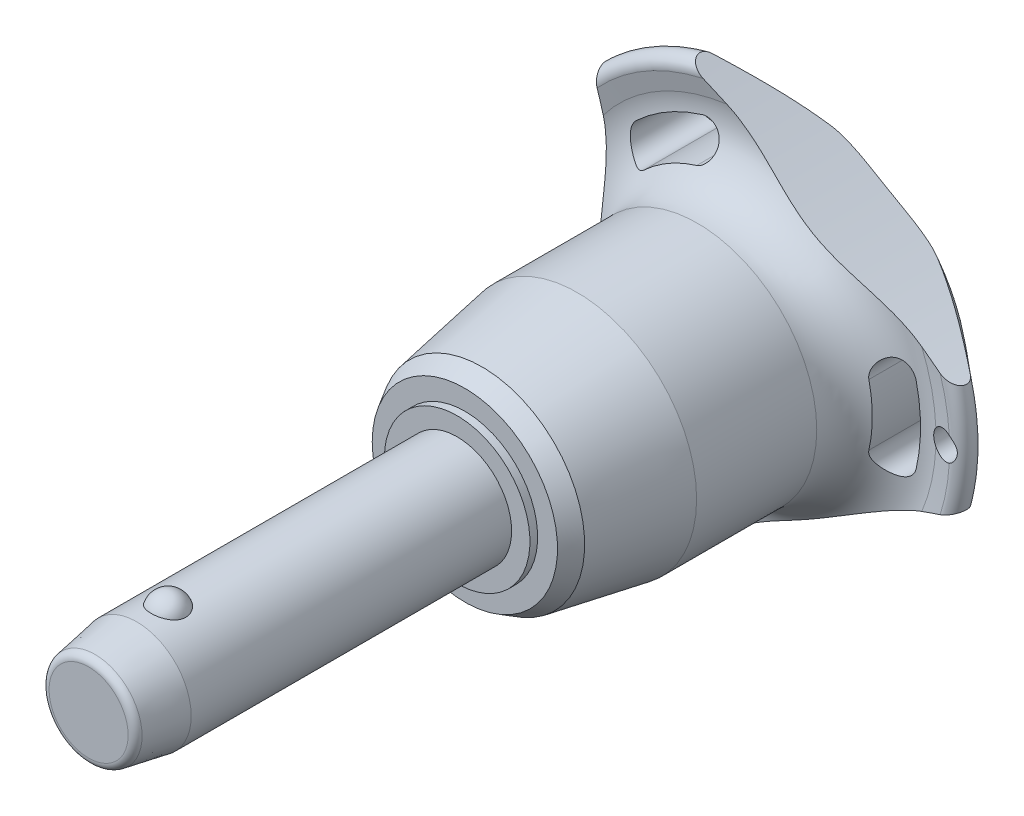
from build123d import *

# Parameters (mm, degrees)
SKETCH1_R           = 6
BOSS_EXTRUDE1_DEPTH = 30
SKETCH2_R           = 5.15
BOSS_EXTRUDE2_DEPTH = 39.7
BOSS_EXTRUDE3_START = 10.6
SKETCH1_2_R         = 6
BOSS_EXTRUDE3_DEPTH = 10.6
CHAMFER1_SIZE       = 5.3
CHAMFER1_SIZE2      = 0.934532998
FILLET1_R           = 0.85
SKETCH6_R           = 144.275
CUT_EXTRUDE1_DEPTH  = 78.404041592
CIRPATTERN1_COUNT   = 3
SKETCH7_R           = 1.5
CUT_EXTRUDE2_DEPTH  = 78.144330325


with BuildPart() as part:
    # Sketch1 → Boss-Extrude1 (new body)
    with BuildSketch(Plane.XY):
        Circle(SKETCH1_R)
    extrude(amount=-BOSS_EXTRUDE1_DEPTH)

    # Sketch2 → Boss-Extrude2 (add)
    with BuildSketch(Plane(origin=(0, 0, -30), x_dir=(-1, 0, 0), z_dir=(0, 0, -1))):
        Circle(SKETCH2_R)
    extrude(amount=BOSS_EXTRUDE2_DEPTH)

    # Sketch3 → Revolve1 (revolve)
    with BuildSketch(Plane(origin=(0, 0, 0), x_dir=(0, 0, -1), z_dir=(1, 0, 0))):
        with BuildLine():
            Line((-1.854049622, 7.25), (-1.854049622, 3.25))
            ThreePointArc((-1.854049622, 3.25), (0.145950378, 5.25), (-1.854049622, 7.25))
        make_face()
        with BuildLine():
            Line((-1.854049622, -3.25), (-1.854049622, -7.25))
            ThreePointArc((-1.854049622, -7.25), (0.145950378, -5.25), (-1.854049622, -3.25))
        make_face()
    revolve(axis=Axis((0, -3.25, 1.854049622), (0, 1, 0)))

    # Sketch1_2 → Boss-Extrude3 (add)
    with BuildSketch(Plane.XY.offset(BOSS_EXTRUDE3_START)):
        Circle(SKETCH1_2_R)
    extrude(amount=-BOSS_EXTRUDE3_DEPTH)

    # Chamfer1
    chamfer1_edges = [part.edges().sort_by_distance(p)[0] for p in [
        (-6, 0, 10.6),
    ]]
    chamfer1_side = [part.faces().sort_by_distance(p)[0] for p in [
        (-6, 0, -9.7),
    ]]
    chamfer(chamfer1_edges, length=CHAMFER1_SIZE, length2=CHAMFER1_SIZE2, reference=chamfer1_side[0])

    # Fillet1
    fillet1_edges = [part.edges().sort_by_distance(p)[0] for p in [
        (-5.065467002, 0, 10.6),
        (5.15, 0, -69.7),
    ]]
    fillet(fillet1_edges, radius=FILLET1_R)

    # Sketch4 → Revolve2 (revolve)
    with BuildSketch(Plane(origin=(0, 0, 0), x_dir=(0, 0, -1), z_dir=(1, 0, 0)), mode=Mode.PRIVATE) as revolve2_sk:
        Polygon((30, 0), (30, 8.017240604), (30.85, 8.017240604), (30.85, 10.206249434), (32.745737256, 11.300753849), (43.233333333, 13.15), (56.466666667, 13.15), (56.466666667, 0), align=None)
    revolve(revolve2_sk.sketch.rotate(Axis((0, 0, -56.466666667), (0, 0, 1)), 90), axis=Axis((0, 0, -56.466666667), (0, 0, 1)))

    # Sketch5 → Revolve3 (revolve)
    with BuildSketch(Plane(origin=(0, 0, 0), x_dir=(0, 0, -1), z_dir=(1, 0, 0)), mode=Mode.PRIVATE) as revolve3_sk:
        with BuildLine():
            Line((62.32877039, 20.428960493), (61.910912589, 22.344207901))
            ThreePointArc((61.910912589, 22.344207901), (62.554394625, 23.677136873), (64.002586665, 23.371345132))
            Line((64.002586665, 23.371345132), (69.141488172, 17.247040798))
            ThreePointArc((69.141488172, 17.247040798), (69.7, 15.584758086), (68.978803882, 13.986322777))
            ThreePointArc((68.978803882, 13.986322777), (64.617427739, 7.589034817), (63.083333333, 0))
            Line((63.083333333, 0), (56.466666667, 0))
            Line((56.466666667, 0), (56.466666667, 13.15))
            ThreePointArc((56.466666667, 13.15), (61.139661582, 15.38660811), (62.32877039, 20.428960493))
        make_face()
    revolve(revolve3_sk.sketch.rotate(Axis((0, 0, -63.083333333), (0, 0, 1)), 90), axis=Axis((0, 0, -63.083333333), (0, 0, 1)))

    # Sketch6 → Cut-Extrude1 (cut, through all)
    with BuildSketch(Plane.XY):
        with Locations((-159.975, 0)):
            Circle(SKETCH6_R)
        with BuildLine():
            ThreePointArc((18.131206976, -4.190753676), (18.60922037, 0), (18.131206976, 4.190753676))
            ThreePointArc((18.131206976, 4.190753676), (15.94840906, 5.553949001), (14.585213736, 3.371151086))
            ThreePointArc((14.585213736, 3.371151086), (14.969740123, 0), (14.585213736, -3.371151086))
            ThreePointArc((14.585213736, -3.371151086), (15.94840906, -5.553949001), (18.131206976, -4.190753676))
        make_face()
    cut_extrude1 = extrude(amount=-CUT_EXTRUDE1_DEPTH, mode=Mode.SUBTRACT)

    # CirPattern1: Cut-Extrude1 ×3 about axis
    cirpattern1_axis = Axis((0, 0, 0), (0, 0, 1))
    for i in range(1, CIRPATTERN1_COUNT):
        add(cut_extrude1.rotate(cirpattern1_axis, i * 360 / CIRPATTERN1_COUNT), mode=Mode.SUBTRACT)

    # Sketch7 → Cut-Extrude2 (cut, through all)
    with BuildSketch(Plane.XY):
        with Locations(Location((21.60922037, 0, 0), (0, 0, 297.620773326))):
            Circle(SKETCH7_R)
    extrude(amount=-CUT_EXTRUDE2_DEPTH, mode=Mode.SUBTRACT)


solid = part.part
